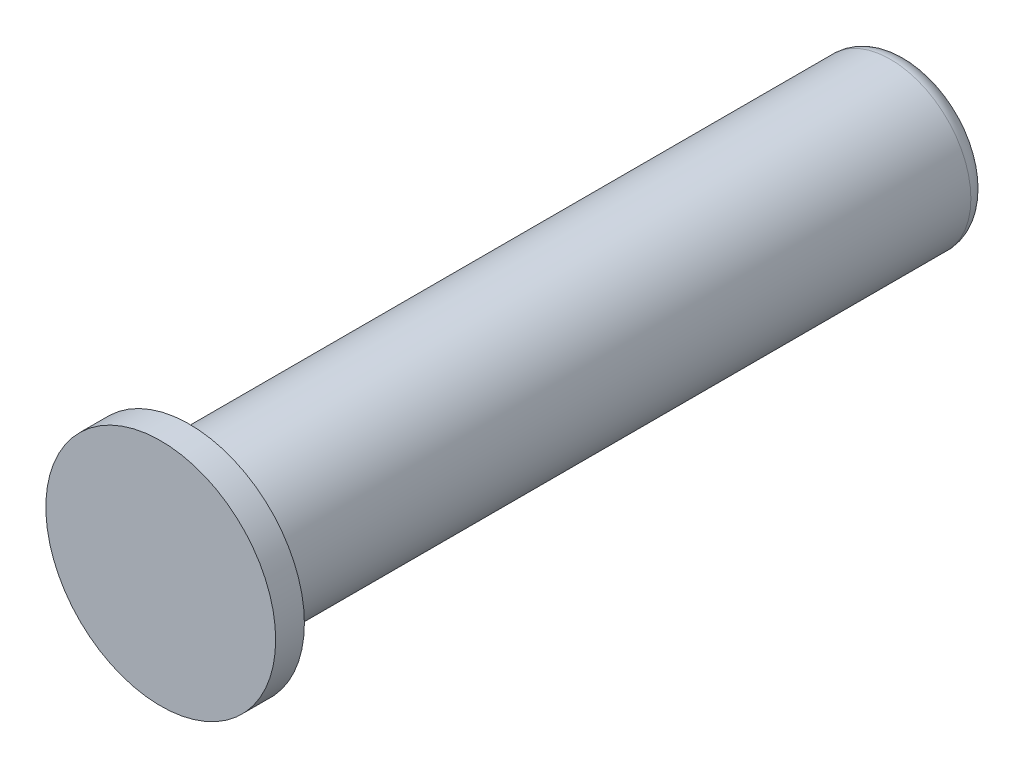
from build123d import *


with BuildPart() as part:
    # Sketch1 → Revolve1 (revolve)
    with BuildSketch(Plane(origin=(0, 0, 0), x_dir=(0, 0, -1), z_dir=(1, 0, 0)), mode=Mode.PRIVATE) as revolve1_sk:
        with BuildLine():
            Line((0, 0), (0, 20))
            Line((0, 20), (5, 20))
            Line((5, 20), (5, 14))
            Line((5, 14), (127, 14))
            ThreePointArc((127, 14), (129.121320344, 13.121320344), (130, 11))
            Line((130, 11), (130, 3.5))
            Line((130, 3.5), (129.5, 3))
            Line((129.5, 3), (121, 3))
            Line((121, 3), (119.267949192, 0))
            Line((119.267949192, 0), (0, 0))
        make_face()
    revolve(revolve1_sk.sketch.rotate(Axis((0, 0, 0), (0, 0, -1)), 90), axis=Axis((0, 0, 0), (0, 0, -1)))


solid = part.part
